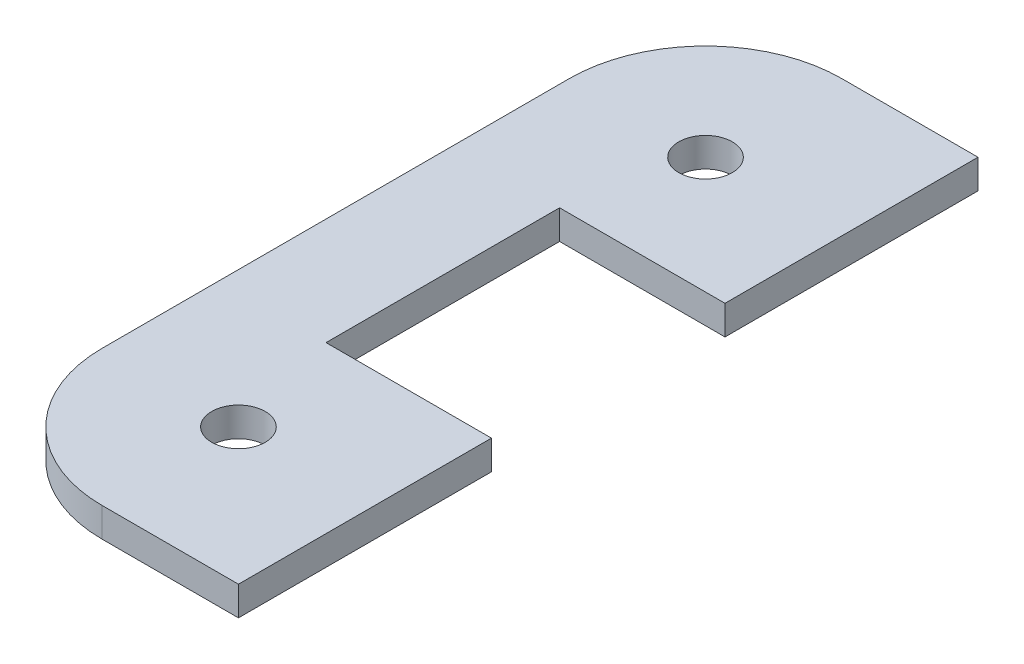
from build123d import *

# Parameters (mm, degrees)
SKETCH1_R      = 2.75
EXTRUDE1_DEPTH = 3


with BuildPart() as part:
    # Sketch1 → Extrude1 (new body)
    with BuildSketch(Plane(origin=(0, 0, 0), x_dir=(1, 0, 0), z_dir=(0, 1, 0))):
        with BuildLine():
            Line((28, 50), (28, 76))
            Line((28, 76), (14, 76))
            ThreePointArc((14, 76), (4.100505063, 71.899494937), (0, 62))
            Line((0, 62), (0, 14))
            ThreePointArc((0, 14), (4.100505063, 4.100505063), (14, 0))
            Line((14, 0), (28, 0))
            Line((28, 0), (28, 26))
            Line((28, 26), (11, 26))
            Line((11, 26), (11, 50))
            Line((11, 50), (28, 50))
        make_face()
        with Locations(Location((14, 62, 0), (0, 0, 270))):
            Circle(SKETCH1_R, mode=Mode.SUBTRACT)
        with Locations(Location((14, 14, 0), (0, 0, 270))):
            Circle(SKETCH1_R, mode=Mode.SUBTRACT)
    extrude(amount=EXTRUDE1_DEPTH)


solid = part.part
